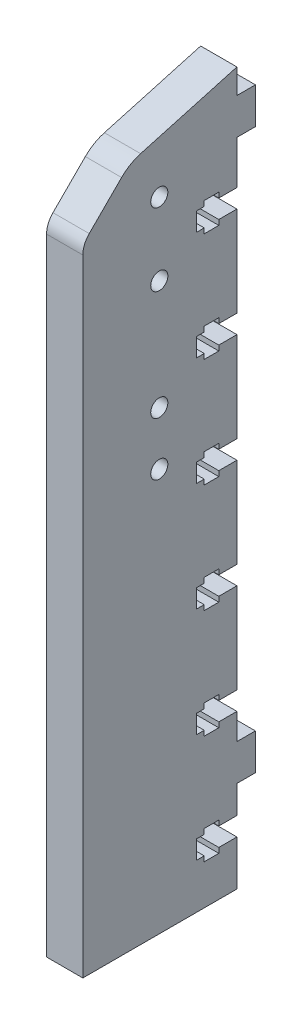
from build123d import *

# Parameters (mm, degrees)
SKETCH1_W           = 12.7
SKETCH1_H           = 276.459229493
BOSS_EXTRUDE1_DEPTH = 53.975
CUT_EXTRUDE1_DEPTH  = 282.965062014
FILLET1_R           = 7.62
SKETCH4_R           = 3
CUT_EXTRUDE2_DEPTH  = 272.407453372
CUT_EXTRUDE3_DEPTH  = 272.407453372
SKETCH7_W           = 6.477
SKETCH7_H           = 12.7
BOSS_EXTRUDE2_DEPTH = 12.7
CUT_EXTRUDE4_DEPTH  = 272.407453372
FILLET2_R           = 15.24


with BuildPart() as part:
    # Sketch1 → Boss-Extrude1 (new body)
    with BuildSketch(Plane.XY):
        with Locations((-6.35, 138.229614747)):
            Rectangle(SKETCH1_W, SKETCH1_H)
    extrude(amount=BOSS_EXTRUDE1_DEPTH)

    # Sketch2 → Cut-Extrude1 (cut, through all)
    with BuildSketch(Plane(origin=(0, 0, 0), x_dir=(0, 0, -1), z_dir=(1, 0, 0))):
        Polygon((0, 276.459229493), (-53.975, 222.484229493), (-53.975, 276.459229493), align=None)
    extrude(amount=-CUT_EXTRUDE1_DEPTH, mode=Mode.SUBTRACT)

    # Fillet1
    fillet1_edges = [part.edges().sort_by_distance(p)[0] for p in [
        (-6.35, 222.484229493, 53.975),
        (-6.35, 276.459229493, 0),
    ]]
    fillet(fillet1_edges, radius=FILLET1_R)

    # Sketch4 → Cut-Extrude2 (cut, through all)
    with BuildSketch(Plane.ZY.offset(12.7)):
        with Locations((27.195361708, 223.518609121)):
            Circle(SKETCH4_R)
        with Locations((27.195361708, 198.118609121)):
            Circle(SKETCH4_R)
        with Locations((27.195361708, 159.637609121)):
            Circle(SKETCH4_R)
        with Locations((27.195361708, 140.968609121)):
            Circle(SKETCH4_R)
    extrude(amount=-CUT_EXTRUDE2_DEPTH, mode=Mode.SUBTRACT)

    # Sketch6 → Cut-Extrude3 (cut, through all)
    with BuildSketch(Plane.ZY.offset(12.7)):
        Polygon((0, 15.8), (6.35, 15.8), (6.35, 14), (11.45, 14), (11.45, 15.8), (14.224, 15.8), (14.224, 22.3), (11.45, 22.3), (11.45, 24.1), (6.35, 24.1), (6.35, 22.3), (0, 22.3), align=None)
        Polygon((0, 53.9), (6.35, 53.9), (6.35, 52.1), (11.45, 52.1), (11.45, 53.9), (14.224, 53.9), (14.224, 60.4), (11.45, 60.4), (11.45, 62.2), (6.35, 62.2), (6.35, 60.4), (0, 60.4), align=None)
        Polygon((0, 92), (6.35, 92), (6.35, 90.2), (11.45, 90.2), (11.45, 92), (14.224, 92), (14.224, 98.5), (11.45, 98.5), (11.45, 100.3), (6.35, 100.3), (6.35, 98.5), (0, 98.5), align=None)
        Polygon((0, 130.1), (6.35, 130.1), (6.35, 128.3), (11.45, 128.3), (11.45, 130.1), (14.224, 130.1), (14.224, 136.6), (11.45, 136.6), (11.45, 138.4), (6.35, 138.4), (6.35, 136.6), (0, 136.6), align=None)
        Polygon((0, 168.2), (6.35, 168.2), (6.35, 166.4), (11.45, 166.4), (11.45, 168.2), (14.224, 168.2), (14.224, 174.7), (11.45, 174.7), (11.45, 176.5), (6.35, 176.5), (6.35, 174.7), (0, 174.7), align=None)
        Polygon((0, 206.3), (6.35, 206.3), (6.35, 204.5), (11.45, 204.5), (11.45, 206.3), (14.224, 206.3), (14.224, 212.8), (11.45, 212.8), (11.45, 214.6), (6.35, 214.6), (6.35, 212.8), (0, 212.8), align=None)
    extrude(amount=-CUT_EXTRUDE3_DEPTH, mode=Mode.SUBTRACT)

    # Sketch7 → Boss-Extrude2 (add)
    with BuildSketch(Plane.ZY.offset(12.7)):
        with Locations((-3.2385, 234.39)):
            Rectangle(SKETCH7_W, SKETCH7_H)
        with Locations((-3.2385, 38.39)):
            Rectangle(SKETCH7_W, SKETCH7_H)
    extrude(amount=-BOSS_EXTRUDE2_DEPTH)

    # Sketch8 → Cut-Extrude4 (cut, through all)
    with BuildSketch(Plane.ZY.offset(12.7)):
        Polygon((0, 249.401461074), (37.576415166, 238.882814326), (0, 279.4), align=None)
    extrude(amount=-CUT_EXTRUDE4_DEPTH, mode=Mode.SUBTRACT)

    # Fillet2
    fillet2_edges = [part.edges().sort_by_distance(p)[0] for p in [
        (-6.35, 238.882814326, 37.576415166),
    ]]
    fillet(fillet2_edges, radius=FILLET2_R)


solid = part.part
